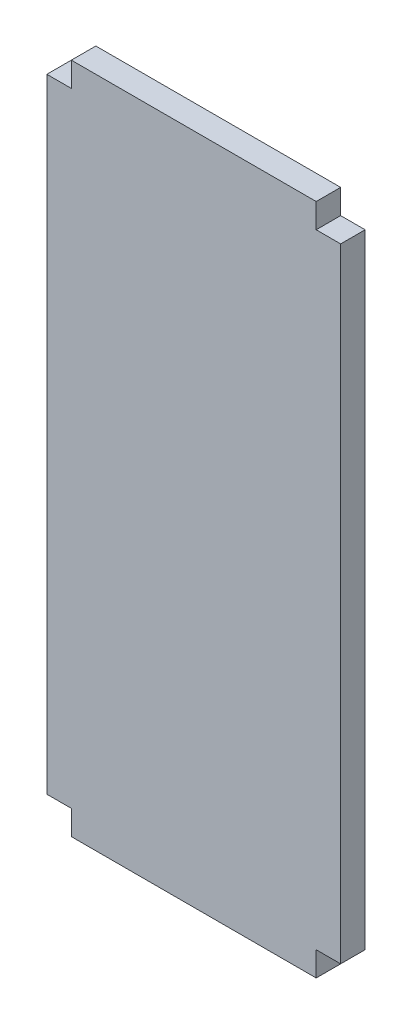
ISO-10303-21;
HEADER;
FILE_DESCRIPTION(('STEP AP214'),'2;1');
FILE_NAME('part.step','',(''),(''),'','','');
FILE_SCHEMA(('AUTOMOTIVE_DESIGN { 1 0 10303 214 1 1 1 1 }'));
ENDSEC;
DATA;
#1=APPLICATION_CONTEXT('core data for automotive mechanical design processes');
#2=APPLICATION_PROTOCOL_DEFINITION('international standard','automotive_design',2000,#1);
#3=PRODUCT_CONTEXT('',#1,'mechanical');
#4=PRODUCT('Part','Part','',(#3));
#5=PRODUCT_RELATED_PRODUCT_CATEGORY('part','',(#4));
#6=PRODUCT_DEFINITION_FORMATION('','',#4);
#7=PRODUCT_DEFINITION_CONTEXT('part definition',#1,'design');
#8=PRODUCT_DEFINITION('design','',#6,#7);
#9=PRODUCT_DEFINITION_SHAPE('','',#8);
#10=(LENGTH_UNIT() NAMED_UNIT(*) SI_UNIT(.MILLI.,.METRE.));
#11=(NAMED_UNIT(*) PLANE_ANGLE_UNIT() SI_UNIT($,.RADIAN.));
#12=(NAMED_UNIT(*) SI_UNIT($,.STERADIAN.) SOLID_ANGLE_UNIT());
#13=UNCERTAINTY_MEASURE_WITH_UNIT(LENGTH_MEASURE(1.E-05),#10,'distance_accuracy_value','');
#14=(GEOMETRIC_REPRESENTATION_CONTEXT(3) GLOBAL_UNCERTAINTY_ASSIGNED_CONTEXT((#13)) GLOBAL_UNIT_ASSIGNED_CONTEXT((#10,
#11,#12)) REPRESENTATION_CONTEXT('',''));
#15=CARTESIAN_POINT('',(0.,0.,0.));
#16=DIRECTION('',(0.,0.,1.));
#17=DIRECTION('',(1.,0.,0.));
#18=AXIS2_PLACEMENT_3D('',#15,#16,#17);
#19=CARTESIAN_POINT('',(-18.,-38.2,3.));
#20=DIRECTION('',(0.,1.,0.));
#21=DIRECTION('',(0.,0.,1.));
#22=AXIS2_PLACEMENT_3D('',#19,#20,#21);
#23=PLANE('',#22);
#24=DIRECTION('',(0.,0.,-1.));
#25=VECTOR('',#24,1.);
#26=CARTESIAN_POINT('',(-15.,-38.2,3.));
#27=LINE('',#26,#25);
#28=CARTESIAN_POINT('',(-15.,-38.2,3.));
#29=VERTEX_POINT('',#28);
#30=CARTESIAN_POINT('',(-15.,-38.2,0.));
#31=VERTEX_POINT('',#30);
#32=EDGE_CURVE('E47',#29,#31,#27,.T.);
#33=ORIENTED_EDGE('',*,*,#32,.F.);
#34=DIRECTION('',(1.,0.,0.));
#35=VECTOR('',#34,1.);
#36=CARTESIAN_POINT('',(-18.,-38.2,3.));
#37=LINE('',#36,#35);
#38=CARTESIAN_POINT('',(-18.,-38.2,3.));
#39=VERTEX_POINT('',#38);
#40=EDGE_CURVE('E189',#39,#29,#37,.T.);
#41=ORIENTED_EDGE('',*,*,#40,.F.);
#42=DIRECTION('',(0.,0.,-1.));
#43=VECTOR('',#42,1.);
#44=CARTESIAN_POINT('',(-18.,-38.2,3.));
#45=LINE('',#44,#43);
#46=CARTESIAN_POINT('',(-18.,-38.2,0.));
#47=VERTEX_POINT('',#46);
#48=EDGE_CURVE('E203',#39,#47,#45,.T.);
#49=ORIENTED_EDGE('',*,*,#48,.T.);
#50=DIRECTION('',(1.,0.,0.));
#51=VECTOR('',#50,1.);
#52=CARTESIAN_POINT('',(-18.,-38.2,0.));
#53=LINE('',#52,#51);
#54=EDGE_CURVE('E182',#47,#31,#53,.T.);
#55=ORIENTED_EDGE('',*,*,#54,.T.);
#56=EDGE_LOOP('',(#33,#41,#49,#55));
#57=FACE_BOUND('',#56,.T.);
#58=ADVANCED_FACE('F32',(#57),#23,.F.);
#59=DIRECTION('',(0.,0.,1.));
#60=VECTOR('',#59,1.);
#61=CARTESIAN_POINT('',(15.,-38.2,3.00000000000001));
#62=LINE('',#61,#60);
#63=CARTESIAN_POINT('',(15.,-38.2,0.));
#64=VERTEX_POINT('',#63);
#65=CARTESIAN_POINT('',(15.,-38.2,3.00000000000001));
#66=VERTEX_POINT('',#65);
#67=EDGE_CURVE('E55',#64,#66,#62,.T.);
#68=ORIENTED_EDGE('',*,*,#67,.F.);
#69=CARTESIAN_POINT('',(18.,-38.2,0.));
#70=VERTEX_POINT('',#69);
#71=EDGE_CURVE('E199',#64,#70,#53,.T.);
#72=ORIENTED_EDGE('',*,*,#71,.T.);
#73=DIRECTION('',(0.,0.,-1.));
#74=VECTOR('',#73,1.);
#75=CARTESIAN_POINT('',(18.,-38.2,3.));
#76=LINE('',#75,#74);
#77=CARTESIAN_POINT('',(18.,-38.2,3.));
#78=VERTEX_POINT('',#77);
#79=EDGE_CURVE('E191',#78,#70,#76,.T.);
#80=ORIENTED_EDGE('',*,*,#79,.F.);
#81=EDGE_CURVE('E188',#66,#78,#37,.T.);
#82=ORIENTED_EDGE('',*,*,#81,.F.);
#83=EDGE_LOOP('',(#68,#72,#80,#82));
#84=FACE_BOUND('',#83,.T.);
#85=ADVANCED_FACE('F230',(#84),#23,.F.);
#86=CARTESIAN_POINT('',(-18.,38.2,3.));
#87=DIRECTION('',(0.,-1.,0.));
#88=DIRECTION('',(0.,0.,-1.));
#89=AXIS2_PLACEMENT_3D('',#86,#87,#88);
#90=PLANE('',#89);
#91=DIRECTION('',(0.,0.,1.));
#92=VECTOR('',#91,1.);
#93=CARTESIAN_POINT('',(-15.,38.2,0.));
#94=LINE('',#93,#92);
#95=CARTESIAN_POINT('',(-15.,38.2,0.));
#96=VERTEX_POINT('',#95);
#97=CARTESIAN_POINT('',(-15.,38.2,3.));
#98=VERTEX_POINT('',#97);
#99=EDGE_CURVE('E145',#96,#98,#94,.T.);
#100=ORIENTED_EDGE('',*,*,#99,.F.);
#101=DIRECTION('',(-1.,0.,0.));
#102=VECTOR('',#101,1.);
#103=CARTESIAN_POINT('',(-18.,38.2,0.));
#104=LINE('',#103,#102);
#105=CARTESIAN_POINT('',(-18.,38.2,0.));
#106=VERTEX_POINT('',#105);
#107=EDGE_CURVE('E194',#96,#106,#104,.T.);
#108=ORIENTED_EDGE('',*,*,#107,.T.);
#109=DIRECTION('',(0.,0.,-1.));
#110=VECTOR('',#109,1.);
#111=CARTESIAN_POINT('',(-18.,38.2,3.));
#112=LINE('',#111,#110);
#113=CARTESIAN_POINT('',(-18.,38.2,3.));
#114=VERTEX_POINT('',#113);
#115=EDGE_CURVE('E40',#114,#106,#112,.T.);
#116=ORIENTED_EDGE('',*,*,#115,.F.);
#117=DIRECTION('',(-1.,0.,0.));
#118=VECTOR('',#117,1.);
#119=CARTESIAN_POINT('',(-18.,38.2,3.));
#120=LINE('',#119,#118);
#121=EDGE_CURVE('E181',#98,#114,#120,.T.);
#122=ORIENTED_EDGE('',*,*,#121,.F.);
#123=EDGE_LOOP('',(#100,#108,#116,#122));
#124=FACE_BOUND('',#123,.T.);
#125=ADVANCED_FACE('F246',(#124),#90,.F.);
#126=DIRECTION('',(0.,0.,-1.));
#127=VECTOR('',#126,1.);
#128=CARTESIAN_POINT('',(15.,38.2,0.));
#129=LINE('',#128,#127);
#130=CARTESIAN_POINT('',(15.,38.2,3.));
#131=VERTEX_POINT('',#130);
#132=CARTESIAN_POINT('',(15.,38.2,0.));
#133=VERTEX_POINT('',#132);
#134=EDGE_CURVE('E148',#131,#133,#129,.T.);
#135=ORIENTED_EDGE('',*,*,#134,.F.);
#136=CARTESIAN_POINT('',(18.,38.2,3.));
#137=VERTEX_POINT('',#136);
#138=EDGE_CURVE('E183',#137,#131,#120,.T.);
#139=ORIENTED_EDGE('',*,*,#138,.F.);
#140=DIRECTION('',(0.,0.,-1.));
#141=VECTOR('',#140,1.);
#142=CARTESIAN_POINT('',(18.,38.2,3.));
#143=LINE('',#142,#141);
#144=CARTESIAN_POINT('',(18.,38.2,0.));
#145=VERTEX_POINT('',#144);
#146=EDGE_CURVE('E11',#137,#145,#143,.T.);
#147=ORIENTED_EDGE('',*,*,#146,.T.);
#148=EDGE_CURVE('E195',#145,#133,#104,.T.);
#149=ORIENTED_EDGE('',*,*,#148,.T.);
#150=EDGE_LOOP('',(#135,#139,#147,#149));
#151=FACE_BOUND('',#150,.T.);
#152=ADVANCED_FACE('F233',(#151),#90,.F.);
#153=CARTESIAN_POINT('',(18.,-38.2,3.));
#154=DIRECTION('',(-1.,0.,0.));
#155=DIRECTION('',(0.,0.,1.));
#156=AXIS2_PLACEMENT_3D('',#153,#154,#155);
#157=PLANE('',#156);
#158=DIRECTION('',(0.,1.,0.));
#159=VECTOR('',#158,1.);
#160=CARTESIAN_POINT('',(18.,-38.2,0.));
#161=LINE('',#160,#159);
#162=EDGE_CURVE('E177',#70,#145,#161,.T.);
#163=ORIENTED_EDGE('',*,*,#162,.T.);
#164=ORIENTED_EDGE('',*,*,#146,.F.);
#165=DIRECTION('',(0.,1.,0.));
#166=VECTOR('',#165,1.);
#167=CARTESIAN_POINT('',(18.,-38.2,3.));
#168=LINE('',#167,#166);
#169=EDGE_CURVE('E178',#78,#137,#168,.T.);
#170=ORIENTED_EDGE('',*,*,#169,.F.);
#171=ORIENTED_EDGE('',*,*,#79,.T.);
#172=EDGE_LOOP('',(#163,#164,#170,#171));
#173=FACE_BOUND('',#172,.T.);
#174=ADVANCED_FACE('F34',(#173),#157,.F.);
#175=CARTESIAN_POINT('',(-18.,-38.2,3.));
#176=DIRECTION('',(1.,0.,0.));
#177=DIRECTION('',(0.,0.,-1.));
#178=AXIS2_PLACEMENT_3D('',#175,#176,#177);
#179=PLANE('',#178);
#180=DIRECTION('',(0.,-1.,0.));
#181=VECTOR('',#180,1.);
#182=CARTESIAN_POINT('',(-18.,-38.2,0.));
#183=LINE('',#182,#181);
#184=EDGE_CURVE('E197',#106,#47,#183,.T.);
#185=ORIENTED_EDGE('',*,*,#184,.T.);
#186=ORIENTED_EDGE('',*,*,#48,.F.);
#187=DIRECTION('',(0.,-1.,0.));
#188=VECTOR('',#187,1.);
#189=CARTESIAN_POINT('',(-18.,-38.2,3.));
#190=LINE('',#189,#188);
#191=EDGE_CURVE('E186',#114,#39,#190,.T.);
#192=ORIENTED_EDGE('',*,*,#191,.F.);
#193=ORIENTED_EDGE('',*,*,#115,.T.);
#194=EDGE_LOOP('',(#185,#186,#192,#193));
#195=FACE_BOUND('',#194,.T.);
#196=ADVANCED_FACE('F210',(#195),#179,.F.);
#197=CARTESIAN_POINT('',(0.,0.,3.));
#198=DIRECTION('',(0.,0.,-1.));
#199=DIRECTION('',(-1.,0.,0.));
#200=AXIS2_PLACEMENT_3D('',#197,#198,#199);
#201=PLANE('',#200);
#202=ORIENTED_EDGE('',*,*,#169,.T.);
#203=ORIENTED_EDGE('',*,*,#138,.T.);
#204=DIRECTION('',(0.,-1.,0.));
#205=VECTOR('',#204,1.);
#206=CARTESIAN_POINT('',(15.,41.2,3.));
#207=LINE('',#206,#205);
#208=CARTESIAN_POINT('',(15.,41.2,3.));
#209=VERTEX_POINT('',#208);
#210=EDGE_CURVE('E171',#209,#131,#207,.T.);
#211=ORIENTED_EDGE('',*,*,#210,.F.);
#212=DIRECTION('',(1.,0.,0.));
#213=VECTOR('',#212,1.);
#214=CARTESIAN_POINT('',(-15.,41.2,3.));
#215=LINE('',#214,#213);
#216=CARTESIAN_POINT('',(-15.,41.2,3.));
#217=VERTEX_POINT('',#216);
#218=EDGE_CURVE('E157',#217,#209,#215,.T.);
#219=ORIENTED_EDGE('',*,*,#218,.F.);
#220=DIRECTION('',(0.,-1.,0.));
#221=VECTOR('',#220,1.);
#222=CARTESIAN_POINT('',(-15.,41.2,3.));
#223=LINE('',#222,#221);
#224=EDGE_CURVE('E174',#217,#98,#223,.T.);
#225=ORIENTED_EDGE('',*,*,#224,.T.);
#226=ORIENTED_EDGE('',*,*,#121,.T.);
#227=ORIENTED_EDGE('',*,*,#191,.T.);
#228=ORIENTED_EDGE('',*,*,#40,.T.);
#229=DIRECTION('',(0.,1.,0.));
#230=VECTOR('',#229,1.);
#231=CARTESIAN_POINT('',(-15.,-41.2,3.));
#232=LINE('',#231,#230);
#233=CARTESIAN_POINT('',(-15.,-41.2,3.));
#234=VERTEX_POINT('',#233);
#235=EDGE_CURVE('E217',#234,#29,#232,.T.);
#236=ORIENTED_EDGE('',*,*,#235,.F.);
#237=DIRECTION('',(-1.,0.,0.));
#238=VECTOR('',#237,1.);
#239=CARTESIAN_POINT('',(-15.,-41.2,3.));
#240=LINE('',#239,#238);
#241=CARTESIAN_POINT('',(15.,-41.2,3.00000000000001));
#242=VERTEX_POINT('',#241);
#243=EDGE_CURVE('E139',#242,#234,#240,.T.);
#244=ORIENTED_EDGE('',*,*,#243,.F.);
#245=DIRECTION('',(0.,1.,0.));
#246=VECTOR('',#245,1.);
#247=CARTESIAN_POINT('',(15.,-41.2,3.00000000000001));
#248=LINE('',#247,#246);
#249=EDGE_CURVE('E150',#242,#66,#248,.T.);
#250=ORIENTED_EDGE('',*,*,#249,.T.);
#251=ORIENTED_EDGE('',*,*,#81,.T.);
#252=EDGE_LOOP('',(#202,#203,#211,#219,#225,#226,#227,#228,#236,#244,#250,#251));
#253=FACE_BOUND('',#252,.T.);
#254=ADVANCED_FACE('F216',(#253),#201,.F.);
#255=CARTESIAN_POINT('',(0.,0.,0.));
#256=DIRECTION('',(0.,0.,-1.));
#257=DIRECTION('',(-1.,0.,0.));
#258=AXIS2_PLACEMENT_3D('',#255,#256,#257);
#259=PLANE('',#258);
#260=ORIENTED_EDGE('',*,*,#162,.F.);
#261=ORIENTED_EDGE('',*,*,#71,.F.);
#262=DIRECTION('',(0.,1.,0.));
#263=VECTOR('',#262,1.);
#264=CARTESIAN_POINT('',(15.,-41.2,0.));
#265=LINE('',#264,#263);
#266=CARTESIAN_POINT('',(15.,-41.2,0.));
#267=VERTEX_POINT('',#266);
#268=EDGE_CURVE('E130',#267,#64,#265,.T.);
#269=ORIENTED_EDGE('',*,*,#268,.F.);
#270=DIRECTION('',(1.,0.,0.));
#271=VECTOR('',#270,1.);
#272=CARTESIAN_POINT('',(-15.,-41.2,0.));
#273=LINE('',#272,#271);
#274=CARTESIAN_POINT('',(-15.,-41.2,0.));
#275=VERTEX_POINT('',#274);
#276=EDGE_CURVE('E122',#275,#267,#273,.T.);
#277=ORIENTED_EDGE('',*,*,#276,.F.);
#278=DIRECTION('',(0.,1.,0.));
#279=VECTOR('',#278,1.);
#280=CARTESIAN_POINT('',(-15.,-41.2,0.));
#281=LINE('',#280,#279);
#282=EDGE_CURVE('E128',#275,#31,#281,.T.);
#283=ORIENTED_EDGE('',*,*,#282,.T.);
#284=ORIENTED_EDGE('',*,*,#54,.F.);
#285=ORIENTED_EDGE('',*,*,#184,.F.);
#286=ORIENTED_EDGE('',*,*,#107,.F.);
#287=DIRECTION('',(0.,-1.,0.));
#288=VECTOR('',#287,1.);
#289=CARTESIAN_POINT('',(-15.,41.2,0.));
#290=LINE('',#289,#288);
#291=CARTESIAN_POINT('',(-15.,41.2,0.));
#292=VERTEX_POINT('',#291);
#293=EDGE_CURVE('E162',#292,#96,#290,.T.);
#294=ORIENTED_EDGE('',*,*,#293,.F.);
#295=DIRECTION('',(-1.,0.,0.));
#296=VECTOR('',#295,1.);
#297=CARTESIAN_POINT('',(-15.,41.2,0.));
#298=LINE('',#297,#296);
#299=CARTESIAN_POINT('',(15.,41.2,0.));
#300=VERTEX_POINT('',#299);
#301=EDGE_CURVE('E161',#300,#292,#298,.T.);
#302=ORIENTED_EDGE('',*,*,#301,.F.);
#303=DIRECTION('',(0.,-1.,0.));
#304=VECTOR('',#303,1.);
#305=CARTESIAN_POINT('',(15.,41.2,0.));
#306=LINE('',#305,#304);
#307=EDGE_CURVE('E168',#300,#133,#306,.T.);
#308=ORIENTED_EDGE('',*,*,#307,.T.);
#309=ORIENTED_EDGE('',*,*,#148,.F.);
#310=EDGE_LOOP('',(#260,#261,#269,#277,#283,#284,#285,#286,#294,#302,#308,#309));
#311=FACE_BOUND('',#310,.T.);
#312=ADVANCED_FACE('F125',(#311),#259,.T.);
#313=CARTESIAN_POINT('',(-15.,41.2,0.));
#314=DIRECTION('',(1.,0.,0.));
#315=DIRECTION('',(0.,0.,-1.));
#316=AXIS2_PLACEMENT_3D('',#313,#314,#315);
#317=PLANE('',#316);
#318=ORIENTED_EDGE('',*,*,#99,.T.);
#319=ORIENTED_EDGE('',*,*,#224,.F.);
#320=DIRECTION('',(0.,0.,1.));
#321=VECTOR('',#320,1.);
#322=CARTESIAN_POINT('',(-15.,41.2,0.));
#323=LINE('',#322,#321);
#324=EDGE_CURVE('E154',#292,#217,#323,.T.);
#325=ORIENTED_EDGE('',*,*,#324,.F.);
#326=ORIENTED_EDGE('',*,*,#293,.T.);
#327=EDGE_LOOP('',(#318,#319,#325,#326));
#328=FACE_BOUND('',#327,.T.);
#329=ADVANCED_FACE('F245',(#328),#317,.F.);
#330=CARTESIAN_POINT('',(15.,41.2,0.));
#331=DIRECTION('',(-1.,0.,0.));
#332=DIRECTION('',(0.,0.,1.));
#333=AXIS2_PLACEMENT_3D('',#330,#331,#332);
#334=PLANE('',#333);
#335=ORIENTED_EDGE('',*,*,#134,.T.);
#336=ORIENTED_EDGE('',*,*,#307,.F.);
#337=DIRECTION('',(0.,0.,-1.));
#338=VECTOR('',#337,1.);
#339=CARTESIAN_POINT('',(15.,41.2,0.));
#340=LINE('',#339,#338);
#341=EDGE_CURVE('E159',#209,#300,#340,.T.);
#342=ORIENTED_EDGE('',*,*,#341,.F.);
#343=ORIENTED_EDGE('',*,*,#210,.T.);
#344=EDGE_LOOP('',(#335,#336,#342,#343));
#345=FACE_BOUND('',#344,.T.);
#346=ADVANCED_FACE('F237',(#345),#334,.F.);
#347=CARTESIAN_POINT('',(0.,41.2,0.));
#348=DIRECTION('',(0.,1.,0.));
#349=DIRECTION('',(0.,0.,1.));
#350=AXIS2_PLACEMENT_3D('',#347,#348,#349);
#351=PLANE('',#350);
#352=ORIENTED_EDGE('',*,*,#324,.T.);
#353=ORIENTED_EDGE('',*,*,#218,.T.);
#354=ORIENTED_EDGE('',*,*,#341,.T.);
#355=ORIENTED_EDGE('',*,*,#301,.T.);
#356=EDGE_LOOP('',(#352,#353,#354,#355));
#357=FACE_BOUND('',#356,.T.);
#358=ADVANCED_FACE('F241',(#357),#351,.T.);
#359=CARTESIAN_POINT('',(-15.,-41.2,3.));
#360=DIRECTION('',(1.,0.,0.));
#361=DIRECTION('',(0.,0.,-1.));
#362=AXIS2_PLACEMENT_3D('',#359,#360,#361);
#363=PLANE('',#362);
#364=ORIENTED_EDGE('',*,*,#32,.T.);
#365=ORIENTED_EDGE('',*,*,#282,.F.);
#366=DIRECTION('',(0.,0.,-1.));
#367=VECTOR('',#366,1.);
#368=CARTESIAN_POINT('',(-15.,-41.2,3.));
#369=LINE('',#368,#367);
#370=EDGE_CURVE('E134',#234,#275,#369,.T.);
#371=ORIENTED_EDGE('',*,*,#370,.F.);
#372=ORIENTED_EDGE('',*,*,#235,.T.);
#373=EDGE_LOOP('',(#364,#365,#371,#372));
#374=FACE_BOUND('',#373,.T.);
#375=ADVANCED_FACE('F144',(#374),#363,.F.);
#376=CARTESIAN_POINT('',(15.,-41.2,3.00000000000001));
#377=DIRECTION('',(-1.,0.,0.));
#378=DIRECTION('',(0.,0.,1.));
#379=AXIS2_PLACEMENT_3D('',#376,#377,#378);
#380=PLANE('',#379);
#381=ORIENTED_EDGE('',*,*,#67,.T.);
#382=ORIENTED_EDGE('',*,*,#249,.F.);
#383=DIRECTION('',(0.,0.,1.));
#384=VECTOR('',#383,1.);
#385=CARTESIAN_POINT('',(15.,-41.2,3.00000000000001));
#386=LINE('',#385,#384);
#387=EDGE_CURVE('E133',#267,#242,#386,.T.);
#388=ORIENTED_EDGE('',*,*,#387,.F.);
#389=ORIENTED_EDGE('',*,*,#268,.T.);
#390=EDGE_LOOP('',(#381,#382,#388,#389));
#391=FACE_BOUND('',#390,.T.);
#392=ADVANCED_FACE('F226',(#391),#380,.F.);
#393=CARTESIAN_POINT('',(0.,-41.2,0.));
#394=DIRECTION('',(0.,-1.,0.));
#395=DIRECTION('',(0.,0.,-1.));
#396=AXIS2_PLACEMENT_3D('',#393,#394,#395);
#397=PLANE('',#396);
#398=ORIENTED_EDGE('',*,*,#370,.T.);
#399=ORIENTED_EDGE('',*,*,#276,.T.);
#400=ORIENTED_EDGE('',*,*,#387,.T.);
#401=ORIENTED_EDGE('',*,*,#243,.T.);
#402=EDGE_LOOP('',(#398,#399,#400,#401));
#403=FACE_BOUND('',#402,.T.);
#404=ADVANCED_FACE('F137',(#403),#397,.T.);
#405=CLOSED_SHELL('',(#58,#85,#125,#152,#174,#196,#254,#312,#329,#346,#358,#375,#392,#404));
#406=MANIFOLD_SOLID_BREP('B2',#405);
#407=ADVANCED_BREP_SHAPE_REPRESENTATION('',(#18,#406),#14);
#408=SHAPE_DEFINITION_REPRESENTATION(#9,#407);
ENDSEC;
END-ISO-10303-21;
